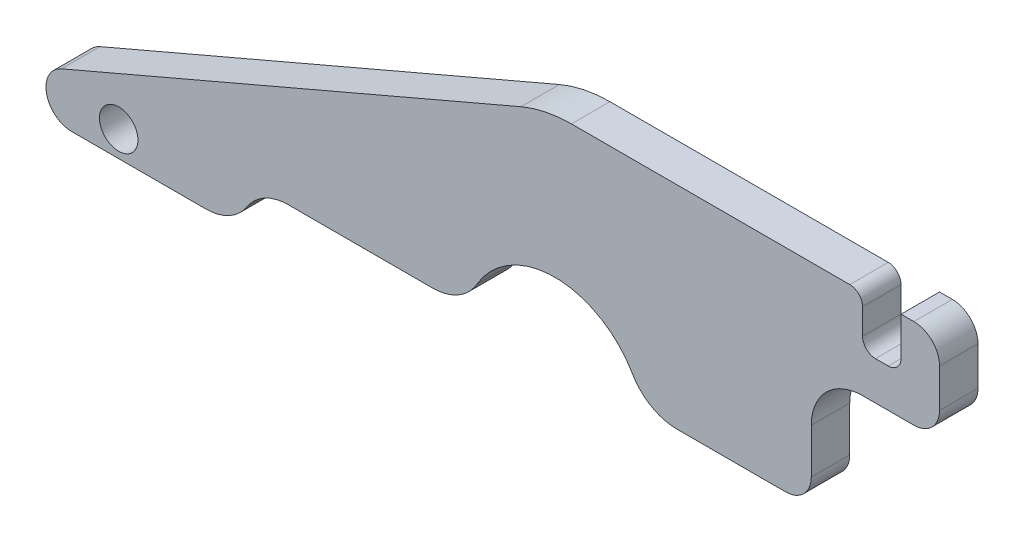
from build123d import *

# Parameters (mm, degrees)
SKETCH1_R           = 0.75
BOSS_EXTRUDE1_DEPTH = 1.5


with BuildPart() as part:
    # Sketch1 → Boss-Extrude1 (new body)
    with BuildSketch(Plane.XY):
        with BuildLine():
            Line((-27.228976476, 5.48163462), (-9.31836058, 13.158173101))
            ThreePointArc((-9.31836058, 13.158173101), (-8.354036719, 13.46037533), (-7.348642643, 13.5625))
            Line((-7.348642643, 13.5625), (3.5, 13.5625))
            ThreePointArc((3.5, 13.5625), (3.853553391, 13.416053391), (4, 13.0625))
            Line((4, 13.0625), (4, 12.0625))
            ThreePointArc((4, 12.0625), (4.146446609, 11.708946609), (4.5, 11.5625))
            Line((4.5, 11.5625), (5, 11.5625))
            ThreePointArc((5, 11.5625), (5.353553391, 11.708946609), (5.5, 12.0625))
            Line((5.5, 12.0625), (5.5, 13.5625))
            Line((5.5, 13.5625), (6, 13.5625))
            ThreePointArc((6, 13.5625), (6.707106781, 13.269606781), (7, 12.5625))
            Line((7, 12.5625), (7, 11.0625))
            ThreePointArc((7, 11.0625), (6.707106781, 10.355393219), (6, 10.0625))
            Line((6, 10.0625), (4.155249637, 10.0625))
            Line((4.155249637, 10.0625), (4, 10.0625))
            ThreePointArc((4, 10.0625), (2.585786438, 9.476713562), (2, 8.0625))
            Line((2, 8.0625), (2, 6.3125))
            ThreePointArc((2, 6.3125), (1.707106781, 5.605393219), (1, 5.3125))
            Line((1, 5.3125), (-3.236860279, 5.3125))
            ThreePointArc((-3.236860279, 5.3125), (-4.236860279, 5.580449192), (-4.968911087, 6.3125))
            ThreePointArc((-4.968911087, 6.3125), (-8, 8.0625), (-11.031088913, 6.3125))
            ThreePointArc((-11.031088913, 6.3125), (-11.763139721, 5.580449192), (-12.763139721, 5.3125))
            Line((-12.763139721, 5.3125), (-18.396113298, 5.3125))
            ThreePointArc((-18.396113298, 5.3125), (-19.309633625, 5.07952209), (-20, 4.4375))
            ThreePointArc((-20, 4.4375), (-20.690366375, 3.79547791), (-21.603886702, 3.5625))
            Line((-21.603886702, 3.5625), (-26.835032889, 3.5625))
            ThreePointArc((-26.835032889, 3.5625), (-27.814607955, 4.361421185), (-27.228976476, 5.48163462))
        make_face()
        with Locations((-25, 4.5625)):
            Circle(SKETCH1_R, mode=Mode.SUBTRACT)
    extrude(amount=BOSS_EXTRUDE1_DEPTH)


solid = part.part
